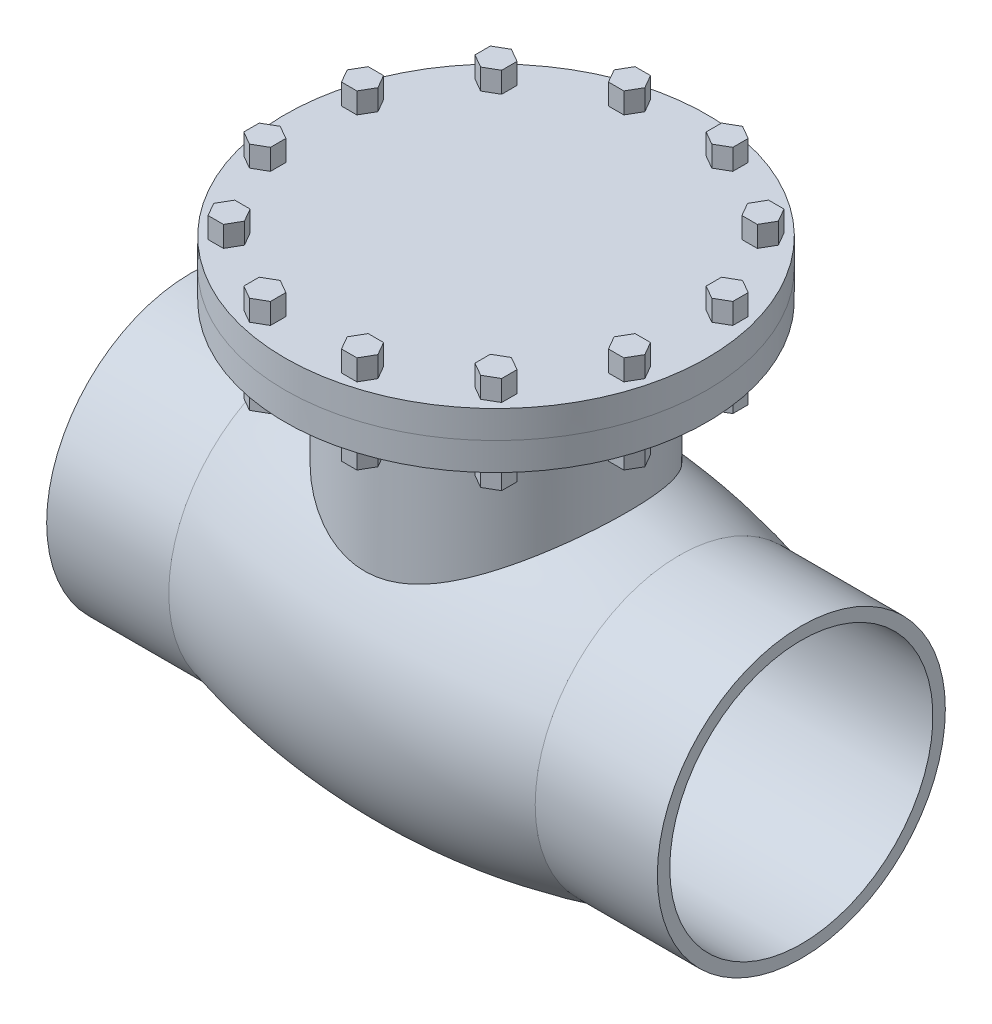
from build123d import *

# Parameters (mm, degrees)
BODY_EXTRUDE_SKETCH_R  = 150.4
BODY_EXTRUDE_DEPTH     = 376
FLANGE_BOTTOM_SKETCH_R = 241.3
FLANGE_BOTTOM_DEPTH    = 31.75
FLANGE_TOP_SKETCH_R    = 241.3
FLANGE_TOP_DEPTH       = 31.75
ID_SKETCH_R            = 150.495
ID_CUT_DEPTH           = 830.158573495
BOLT_DEPTH             = 111.125
BOLT_PATTERN_COUNT     = 12
BOLT_PATTERN_ANGLE     = 330


with BuildPart() as part:
    # Flow Extrude Sketch → Flow Extrude (revolve)
    with BuildSketch(Plane.XY, mode=Mode.PRIVATE) as flow_extrude_sk:
        with BuildLine():
            Line((209.55, 164.719), (349.25, 164.719))
            Line((349.25, 164.719), (349.25, 0))
            Line((349.25, 0), (-349.25, 0))
            Line((-349.25, 0), (-349.25, 164.719))
            Line((-349.25, 164.719), (-209.55, 164.719))
            ThreePointArc((-209.55, 164.719), (0, 192.0875), (209.55, 164.719))
        make_face()
    revolve(flow_extrude_sk.sketch.rotate(Axis((-245.321131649, 0, 0), (1, 0, 0)), 90), axis=Axis((-245.321131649, 0, 0), (1, 0, 0)))

    # Body Extrude Sketch → Body Extrude (add)
    with BuildSketch(Plane(origin=(0, 0, 0), x_dir=(1, 0, 0), z_dir=(0, 1, 0))):
        with Locations(Location((0, 0, 0), (0, 0, 114.200462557))):
            Circle(BODY_EXTRUDE_SKETCH_R)
    extrude(amount=BODY_EXTRUDE_DEPTH)

    # Flange Bottom Sketch → Flange Bottom (add)
    with BuildSketch(Plane(origin=(0, 376, 0), x_dir=(-1, 0, 0), z_dir=(0, 1, 0))):
        with Locations(Location((0, 0, 0), (0, 0, 90))):
            Circle(FLANGE_BOTTOM_SKETCH_R)
    extrude(amount=-FLANGE_BOTTOM_DEPTH)

    # Flange Top Sketch → Flange Top (add)
    with BuildSketch(Plane.XZ.offset(-344.25)):
        with Locations(Location((0, 0, 0), (0, 0, 90))):
            Circle(FLANGE_TOP_SKETCH_R)
    extrude(amount=FLANGE_TOP_DEPTH)

    # ID Sketch → ID Cut (cut, through all)
    with BuildSketch(Plane.ZY.offset(-349.25)):
        Circle(ID_SKETCH_R)
    extrude(amount=ID_CUT_DEPTH, mode=Mode.SUBTRACT)

    # Bolt Sketch → Bolt (add)
    with BuildSketch(Plane(origin=(0, 399.8125, 0), x_dir=(-1, 0, 0), z_dir=(0, 1, 0))):
        Polygon((-208.543385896, -38.281395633), (-223.783385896, -47.080213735), (-223.783385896, -64.67784994), (-208.543385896, -73.476668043), (-193.303385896, -64.67784994), (-193.303385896, -47.080213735), align=None)
    bolt = extrude(amount=-BOLT_DEPTH)

    # Bolt Pattern: Bolt ×12 about axis
    bolt_pattern_axis = Axis((0, 344.25, 0), (0, 1, 0))
    for i in range(1, BOLT_PATTERN_COUNT):
        add(bolt.rotate(bolt_pattern_axis, i * BOLT_PATTERN_ANGLE / (BOLT_PATTERN_COUNT - 1)))


solid = part.part
